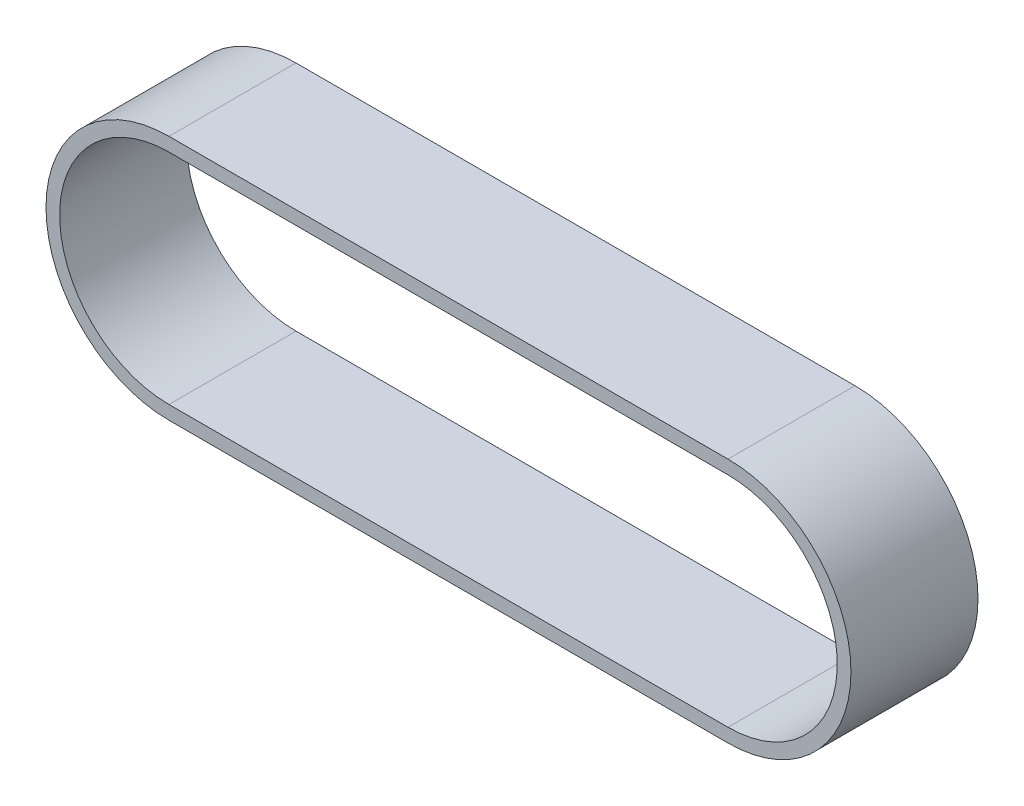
from build123d import *

# Parameters (mm, degrees)
BOSS_EXTRUDE1_DEPTH = 118.11


with BuildPart() as part:
    # Sketch1 → Boss-Extrude1 (new body)
    with BuildSketch(Plane.XY):
        with BuildLine():
            Line((-259.842, 114.3), (259.842, 114.3))
            ThreePointArc((259.842, 114.3), (374.142, 0), (259.842, -114.3))
            Line((259.842, -114.3), (-259.842, -114.3))
            ThreePointArc((-259.842, -114.3), (-374.142, 0), (-259.842, 114.3))
        make_face()
        with BuildLine():
            Line((-259.842, 101.6), (259.842, 101.6))
            ThreePointArc((259.842, 101.6), (361.442, 0), (259.842, -101.6))
            Line((259.842, -101.6), (-259.842, -101.6))
            ThreePointArc((-259.842, -101.6), (-361.442, 0), (-259.842, 101.6))
        make_face(mode=Mode.SUBTRACT)
    extrude(amount=BOSS_EXTRUDE1_DEPTH)


solid = part.part
